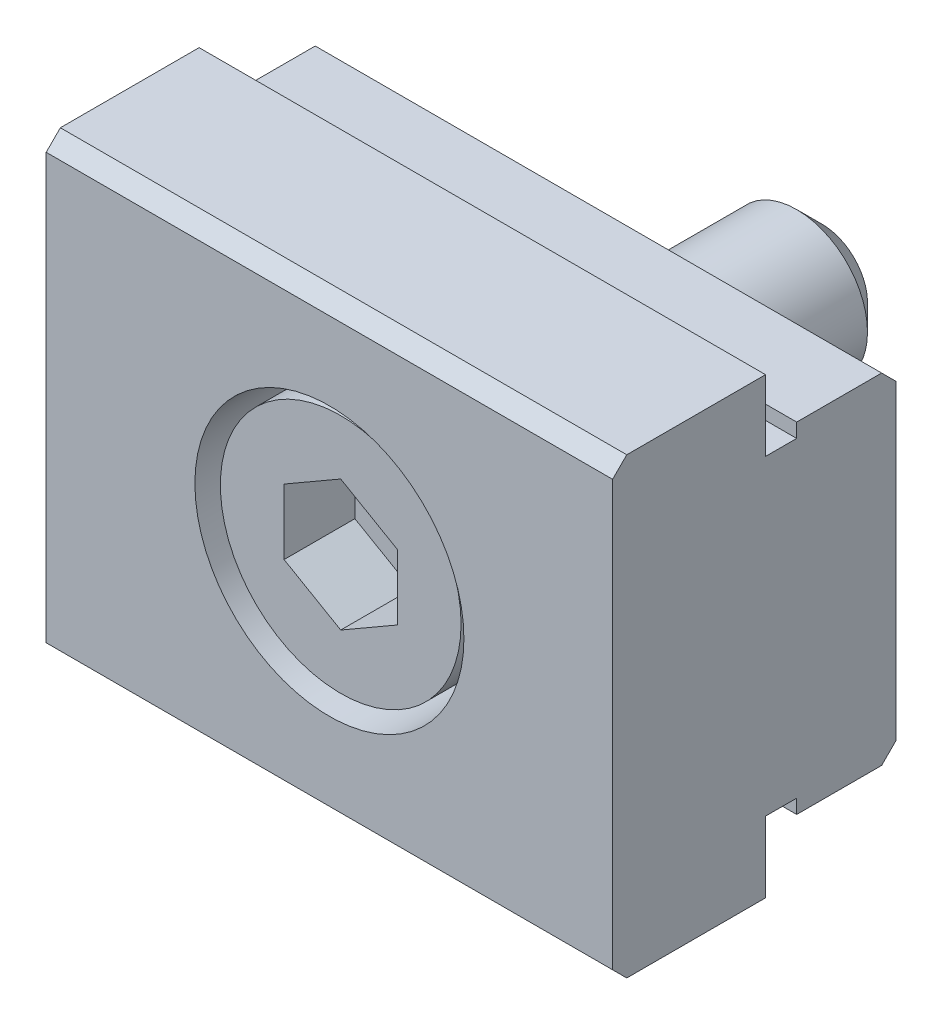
ISO-10303-21;
HEADER;
FILE_DESCRIPTION(('STEP AP214'),'2;1');
FILE_NAME('part.step','',(''),(''),'','','');
FILE_SCHEMA(('AUTOMOTIVE_DESIGN { 1 0 10303 214 1 1 1 1 }'));
ENDSEC;
DATA;
#1=APPLICATION_CONTEXT('core data for automotive mechanical design processes');
#2=APPLICATION_PROTOCOL_DEFINITION('international standard','automotive_design',2000,#1);
#3=PRODUCT_CONTEXT('',#1,'mechanical');
#4=PRODUCT('Part','Part','',(#3));
#5=PRODUCT_RELATED_PRODUCT_CATEGORY('part','',(#4));
#6=PRODUCT_DEFINITION_FORMATION('','',#4);
#7=PRODUCT_DEFINITION_CONTEXT('part definition',#1,'design');
#8=PRODUCT_DEFINITION('design','',#6,#7);
#9=PRODUCT_DEFINITION_SHAPE('','',#8);
#10=(LENGTH_UNIT() NAMED_UNIT(*) SI_UNIT(.MILLI.,.METRE.));
#11=(NAMED_UNIT(*) PLANE_ANGLE_UNIT() SI_UNIT($,.RADIAN.));
#12=(NAMED_UNIT(*) SI_UNIT($,.STERADIAN.) SOLID_ANGLE_UNIT());
#13=UNCERTAINTY_MEASURE_WITH_UNIT(LENGTH_MEASURE(1.E-05),#10,'distance_accuracy_value','');
#14=(GEOMETRIC_REPRESENTATION_CONTEXT(3) GLOBAL_UNCERTAINTY_ASSIGNED_CONTEXT((#13)) GLOBAL_UNIT_ASSIGNED_CONTEXT((#10,
#11,#12)) REPRESENTATION_CONTEXT('',''));
#15=CARTESIAN_POINT('',(0.,0.,0.));
#16=DIRECTION('',(0.,0.,1.));
#17=DIRECTION('',(1.,0.,0.));
#18=AXIS2_PLACEMENT_3D('',#15,#16,#17);
#19=CARTESIAN_POINT('',(-12.5,-6.,-1.1));
#20=DIRECTION('',(0.,0.,-1.));
#21=DIRECTION('',(-1.,0.,0.));
#22=AXIS2_PLACEMENT_3D('',#19,#20,#21);
#23=PLANE('',#22);
#24=DIRECTION('',(0.,1.,0.));
#25=VECTOR('',#24,1.);
#26=CARTESIAN_POINT('',(-10.,-6.,-1.1));
#27=LINE('',#26,#25);
#28=CARTESIAN_POINT('',(-10.,-6.,-1.1));
#29=VERTEX_POINT('',#28);
#30=CARTESIAN_POINT('',(-10.,-5.5,-1.1));
#31=VERTEX_POINT('',#30);
#32=EDGE_CURVE('E353',#29,#31,#27,.T.);
#33=ORIENTED_EDGE('',*,*,#32,.F.);
#34=DIRECTION('',(1.,0.,0.));
#35=VECTOR('',#34,1.);
#36=CARTESIAN_POINT('',(-12.5,-6.,-1.1));
#37=LINE('',#36,#35);
#38=CARTESIAN_POINT('',(10.,-6.,-1.1));
#39=VERTEX_POINT('',#38);
#40=EDGE_CURVE('E208',#29,#39,#37,.T.);
#41=ORIENTED_EDGE('',*,*,#40,.T.);
#42=DIRECTION('',(0.,-1.,0.));
#43=VECTOR('',#42,1.);
#44=CARTESIAN_POINT('',(10.,-6.,-1.1));
#45=LINE('',#44,#43);
#46=CARTESIAN_POINT('',(10.,-5.5,-1.1));
#47=VERTEX_POINT('',#46);
#48=EDGE_CURVE('E336',#47,#39,#45,.T.);
#49=ORIENTED_EDGE('',*,*,#48,.F.);
#50=DIRECTION('',(1.,0.,0.));
#51=VECTOR('',#50,1.);
#52=CARTESIAN_POINT('',(-12.5,-5.5,-1.1));
#53=LINE('',#52,#51);
#54=EDGE_CURVE('E200',#31,#47,#53,.T.);
#55=ORIENTED_EDGE('',*,*,#54,.F.);
#56=EDGE_LOOP('',(#33,#41,#49,#55));
#57=FACE_BOUND('',#56,.T.);
#58=ADVANCED_FACE('F14',(#57),#23,.F.);
#59=CARTESIAN_POINT('',(-12.5,-6.,-4.1));
#60=DIRECTION('',(0.,1.,0.));
#61=DIRECTION('',(1.,0.,0.));
#62=AXIS2_PLACEMENT_3D('',#59,#60,#61);
#63=PLANE('',#62);
#64=DIRECTION('',(0.,0.,1.));
#65=VECTOR('',#64,1.);
#66=CARTESIAN_POINT('',(-10.,-6.,-4.1));
#67=LINE('',#66,#65);
#68=CARTESIAN_POINT('',(-10.,-6.,-4.1));
#69=VERTEX_POINT('',#68);
#70=EDGE_CURVE('E355',#69,#29,#67,.T.);
#71=ORIENTED_EDGE('',*,*,#70,.F.);
#72=DIRECTION('',(1.,0.,0.));
#73=VECTOR('',#72,1.);
#74=CARTESIAN_POINT('',(-12.5,-6.,-4.1));
#75=LINE('',#74,#73);
#76=CARTESIAN_POINT('',(10.,-6.,-4.1));
#77=VERTEX_POINT('',#76);
#78=EDGE_CURVE('E211',#69,#77,#75,.T.);
#79=ORIENTED_EDGE('',*,*,#78,.T.);
#80=DIRECTION('',(0.,0.,-1.));
#81=VECTOR('',#80,1.);
#82=CARTESIAN_POINT('',(10.,-6.,-4.1));
#83=LINE('',#82,#81);
#84=EDGE_CURVE('E338',#39,#77,#83,.T.);
#85=ORIENTED_EDGE('',*,*,#84,.F.);
#86=ORIENTED_EDGE('',*,*,#40,.F.);
#87=EDGE_LOOP('',(#71,#79,#85,#86));
#88=FACE_BOUND('',#87,.T.);
#89=ADVANCED_FACE('F405',(#88),#63,.F.);
#90=CARTESIAN_POINT('',(-12.5,6.,-4.1));
#91=DIRECTION('',(0.,-1.,0.));
#92=DIRECTION('',(-1.,0.,0.));
#93=AXIS2_PLACEMENT_3D('',#90,#91,#92);
#94=PLANE('',#93);
#95=DIRECTION('',(0.,0.,-1.));
#96=VECTOR('',#95,1.);
#97=CARTESIAN_POINT('',(-10.,6.,-4.1));
#98=LINE('',#97,#96);
#99=CARTESIAN_POINT('',(-10.,6.,-1.1));
#100=VERTEX_POINT('',#99);
#101=CARTESIAN_POINT('',(-10.,6.,-4.1));
#102=VERTEX_POINT('',#101);
#103=EDGE_CURVE('E363',#100,#102,#98,.T.);
#104=ORIENTED_EDGE('',*,*,#103,.F.);
#105=DIRECTION('',(1.,0.,0.));
#106=VECTOR('',#105,1.);
#107=CARTESIAN_POINT('',(-12.5,6.,-1.1));
#108=LINE('',#107,#106);
#109=CARTESIAN_POINT('',(10.,6.,-1.1));
#110=VERTEX_POINT('',#109);
#111=EDGE_CURVE('E223',#100,#110,#108,.T.);
#112=ORIENTED_EDGE('',*,*,#111,.T.);
#113=DIRECTION('',(0.,0.,1.));
#114=VECTOR('',#113,1.);
#115=CARTESIAN_POINT('',(10.,6.,-4.1));
#116=LINE('',#115,#114);
#117=CARTESIAN_POINT('',(10.,6.,-4.1));
#118=VERTEX_POINT('',#117);
#119=EDGE_CURVE('E346',#118,#110,#116,.T.);
#120=ORIENTED_EDGE('',*,*,#119,.F.);
#121=DIRECTION('',(1.,0.,0.));
#122=VECTOR('',#121,1.);
#123=CARTESIAN_POINT('',(-12.5,6.,-4.1));
#124=LINE('',#123,#122);
#125=EDGE_CURVE('E220',#102,#118,#124,.T.);
#126=ORIENTED_EDGE('',*,*,#125,.F.);
#127=EDGE_LOOP('',(#104,#112,#120,#126));
#128=FACE_BOUND('',#127,.T.);
#129=ADVANCED_FACE('F385',(#128),#94,.F.);
#130=CARTESIAN_POINT('',(-12.5,6.,-1.1));
#131=DIRECTION('',(0.,0.,-1.));
#132=DIRECTION('',(-1.,0.,0.));
#133=AXIS2_PLACEMENT_3D('',#130,#131,#132);
#134=PLANE('',#133);
#135=DIRECTION('',(0.,1.,0.));
#136=VECTOR('',#135,1.);
#137=CARTESIAN_POINT('',(-10.,6.,-1.1));
#138=LINE('',#137,#136);
#139=CARTESIAN_POINT('',(-10.,5.5,-1.1));
#140=VERTEX_POINT('',#139);
#141=EDGE_CURVE('E365',#140,#100,#138,.T.);
#142=ORIENTED_EDGE('',*,*,#141,.F.);
#143=DIRECTION('',(1.,0.,0.));
#144=VECTOR('',#143,1.);
#145=CARTESIAN_POINT('',(-12.5,5.5,-1.1));
#146=LINE('',#145,#144);
#147=CARTESIAN_POINT('',(10.,5.5,-1.1));
#148=VERTEX_POINT('',#147);
#149=EDGE_CURVE('E226',#140,#148,#146,.T.);
#150=ORIENTED_EDGE('',*,*,#149,.T.);
#151=DIRECTION('',(0.,-1.,0.));
#152=VECTOR('',#151,1.);
#153=CARTESIAN_POINT('',(10.,6.,-1.1));
#154=LINE('',#153,#152);
#155=EDGE_CURVE('E348',#110,#148,#154,.T.);
#156=ORIENTED_EDGE('',*,*,#155,.F.);
#157=ORIENTED_EDGE('',*,*,#111,.F.);
#158=EDGE_LOOP('',(#142,#150,#156,#157));
#159=FACE_BOUND('',#158,.T.);
#160=ADVANCED_FACE('F375',(#159),#134,.F.);
#161=CARTESIAN_POINT('',(-12.5,5.5,-1.1));
#162=DIRECTION('',(0.,-1.,0.));
#163=DIRECTION('',(-1.,0.,0.));
#164=AXIS2_PLACEMENT_3D('',#161,#162,#163);
#165=PLANE('',#164);
#166=DIRECTION('',(0.,0.,-1.));
#167=VECTOR('',#166,1.);
#168=CARTESIAN_POINT('',(-10.,5.5,-1.1));
#169=LINE('',#168,#167);
#170=CARTESIAN_POINT('',(-10.,5.5,0.));
#171=VERTEX_POINT('',#170);
#172=EDGE_CURVE('E202',#171,#140,#169,.T.);
#173=ORIENTED_EDGE('',*,*,#172,.F.);
#174=DIRECTION('',(-1.,0.,0.));
#175=VECTOR('',#174,1.);
#176=CARTESIAN_POINT('',(10.,5.5,0.));
#177=LINE('',#176,#175);
#178=CARTESIAN_POINT('',(10.,5.5,0.));
#179=VERTEX_POINT('',#178);
#180=EDGE_CURVE('E312',#179,#171,#177,.T.);
#181=ORIENTED_EDGE('',*,*,#180,.F.);
#182=DIRECTION('',(0.,0.,1.));
#183=VECTOR('',#182,1.);
#184=CARTESIAN_POINT('',(10.,5.5,-1.1));
#185=LINE('',#184,#183);
#186=EDGE_CURVE('E183',#148,#179,#185,.T.);
#187=ORIENTED_EDGE('',*,*,#186,.F.);
#188=ORIENTED_EDGE('',*,*,#149,.F.);
#189=EDGE_LOOP('',(#173,#181,#187,#188));
#190=FACE_BOUND('',#189,.T.);
#191=ADVANCED_FACE('F378',(#190),#165,.F.);
#192=CARTESIAN_POINT('',(-10.,5.5,0.));
#193=DIRECTION('',(0.,0.,-1.));
#194=DIRECTION('',(-1.,0.,0.));
#195=AXIS2_PLACEMENT_3D('',#192,#193,#194);
#196=PLANE('',#195);
#197=ORIENTED_EDGE('',*,*,#180,.T.);
#198=DIRECTION('',(0.,1.,0.));
#199=VECTOR('',#198,1.);
#200=CARTESIAN_POINT('',(-10.,5.5,0.));
#201=LINE('',#200,#199);
#202=CARTESIAN_POINT('',(-10.,8.,0.));
#203=VERTEX_POINT('',#202);
#204=EDGE_CURVE('E315',#171,#203,#201,.T.);
#205=ORIENTED_EDGE('',*,*,#204,.T.);
#206=DIRECTION('',(1.,0.,0.));
#207=VECTOR('',#206,1.);
#208=CARTESIAN_POINT('',(-10.,8.,0.));
#209=LINE('',#208,#207);
#210=CARTESIAN_POINT('',(10.,8.,0.));
#211=VERTEX_POINT('',#210);
#212=EDGE_CURVE('E317',#203,#211,#209,.T.);
#213=ORIENTED_EDGE('',*,*,#212,.T.);
#214=DIRECTION('',(0.,-1.,0.));
#215=VECTOR('',#214,1.);
#216=CARTESIAN_POINT('',(10.,8.,0.));
#217=LINE('',#216,#215);
#218=EDGE_CURVE('E319',#211,#179,#217,.T.);
#219=ORIENTED_EDGE('',*,*,#218,.T.);
#220=EDGE_LOOP('',(#197,#205,#213,#219));
#221=FACE_BOUND('',#220,.T.);
#222=ADVANCED_FACE('F425',(#221),#196,.T.);
#223=CARTESIAN_POINT('',(-12.5,8.,-0.1));
#224=DIRECTION('',(0.,-1.,0.));
#225=DIRECTION('',(-1.,0.,0.));
#226=AXIS2_PLACEMENT_3D('',#223,#224,#225);
#227=PLANE('',#226);
#228=ORIENTED_EDGE('',*,*,#212,.F.);
#229=DIRECTION('',(0.,0.,1.));
#230=VECTOR('',#229,1.);
#231=CARTESIAN_POINT('',(-10.,8.,-14.6));
#232=LINE('',#231,#230);
#233=CARTESIAN_POINT('',(-10.,8.,4.9));
#234=VERTEX_POINT('',#233);
#235=EDGE_CURVE('E322',#203,#234,#232,.T.);
#236=ORIENTED_EDGE('',*,*,#235,.T.);
#237=DIRECTION('',(1.,0.,0.));
#238=VECTOR('',#237,1.);
#239=CARTESIAN_POINT('',(-12.5,8.,4.9));
#240=LINE('',#239,#238);
#241=CARTESIAN_POINT('',(10.,8.,4.9));
#242=VERTEX_POINT('',#241);
#243=EDGE_CURVE('E229',#234,#242,#240,.T.);
#244=ORIENTED_EDGE('',*,*,#243,.T.);
#245=DIRECTION('',(0.,0.,-1.));
#246=VECTOR('',#245,1.);
#247=CARTESIAN_POINT('',(10.,8.,-14.6));
#248=LINE('',#247,#246);
#249=EDGE_CURVE('E324',#242,#211,#248,.T.);
#250=ORIENTED_EDGE('',*,*,#249,.T.);
#251=EDGE_LOOP('',(#228,#236,#244,#250));
#252=FACE_BOUND('',#251,.T.);
#253=ADVANCED_FACE('F423',(#252),#227,.F.);
#254=CARTESIAN_POINT('',(-12.5,8.,4.9));
#255=DIRECTION('',(0.,-0.707106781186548,-0.707106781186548));
#256=DIRECTION('',(0.,-0.707106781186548,0.707106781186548));
#257=AXIS2_PLACEMENT_3D('',#254,#255,#256);
#258=PLANE('',#257);
#259=DIRECTION('',(0.,0.707106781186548,-0.707106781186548));
#260=VECTOR('',#259,1.);
#261=CARTESIAN_POINT('',(-10.,8.,4.9));
#262=LINE('',#261,#260);
#263=CARTESIAN_POINT('',(-10.,7.5,5.4));
#264=VERTEX_POINT('',#263);
#265=EDGE_CURVE('E182',#264,#234,#262,.T.);
#266=ORIENTED_EDGE('',*,*,#265,.F.);
#267=DIRECTION('',(1.,0.,0.));
#268=VECTOR('',#267,1.);
#269=CARTESIAN_POINT('',(-12.5,7.5,5.4));
#270=LINE('',#269,#268);
#271=CARTESIAN_POINT('',(10.,7.5,5.4));
#272=VERTEX_POINT('',#271);
#273=EDGE_CURVE('E192',#264,#272,#270,.T.);
#274=ORIENTED_EDGE('',*,*,#273,.T.);
#275=DIRECTION('',(0.,-0.707106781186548,0.707106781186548));
#276=VECTOR('',#275,1.);
#277=CARTESIAN_POINT('',(10.,8.,4.9));
#278=LINE('',#277,#276);
#279=EDGE_CURVE('E332',#242,#272,#278,.T.);
#280=ORIENTED_EDGE('',*,*,#279,.F.);
#281=ORIENTED_EDGE('',*,*,#243,.F.);
#282=EDGE_LOOP('',(#266,#274,#280,#281));
#283=FACE_BOUND('',#282,.T.);
#284=ADVANCED_FACE('F419',(#283),#258,.F.);
#285=CARTESIAN_POINT('',(-12.5,7.5,5.4));
#286=DIRECTION('',(0.,0.,-1.));
#287=DIRECTION('',(-1.,0.,0.));
#288=AXIS2_PLACEMENT_3D('',#285,#286,#287);
#289=PLANE('',#288);
#290=CARTESIAN_POINT('',(0.,0.,5.4));
#291=DIRECTION('',(0.,0.,1.));
#292=DIRECTION('',(1.,0.,0.));
#293=AXIS2_PLACEMENT_3D('',#290,#291,#292);
#294=CIRCLE('',#293,4.75);
#295=CARTESIAN_POINT('',(4.75,0.,5.4));
#296=VERTEX_POINT('',#295);
#297=EDGE_CURVE('E301',#296,#296,#294,.T.);
#298=ORIENTED_EDGE('',*,*,#297,.F.);
#299=EDGE_LOOP('',(#298));
#300=FACE_BOUND('',#299,.T.);
#301=DIRECTION('',(0.,1.,0.));
#302=VECTOR('',#301,1.);
#303=CARTESIAN_POINT('',(-10.,7.5,5.4));
#304=LINE('',#303,#302);
#305=CARTESIAN_POINT('',(-10.,-7.5,5.4));
#306=VERTEX_POINT('',#305);
#307=EDGE_CURVE('E24',#306,#264,#304,.T.);
#308=ORIENTED_EDGE('',*,*,#307,.F.);
#309=DIRECTION('',(1.,0.,0.));
#310=VECTOR('',#309,1.);
#311=CARTESIAN_POINT('',(-12.5,-7.5,5.4));
#312=LINE('',#311,#310);
#313=CARTESIAN_POINT('',(10.,-7.5,5.4));
#314=VERTEX_POINT('',#313);
#315=EDGE_CURVE('E190',#306,#314,#312,.T.);
#316=ORIENTED_EDGE('',*,*,#315,.T.);
#317=DIRECTION('',(0.,-1.,0.));
#318=VECTOR('',#317,1.);
#319=CARTESIAN_POINT('',(10.,7.5,5.4));
#320=LINE('',#319,#318);
#321=EDGE_CURVE('E193',#272,#314,#320,.T.);
#322=ORIENTED_EDGE('',*,*,#321,.F.);
#323=ORIENTED_EDGE('',*,*,#273,.F.);
#324=EDGE_LOOP('',(#308,#316,#322,#323));
#325=FACE_BOUND('',#324,.T.);
#326=ADVANCED_FACE('F188',(#300,#325),#289,.F.);
#327=CARTESIAN_POINT('',(0.,0.,5.4));
#328=DIRECTION('',(0.,0.,1.));
#329=DIRECTION('',(1.,0.,0.));
#330=AXIS2_PLACEMENT_3D('',#327,#328,#329);
#331=CYLINDRICAL_SURFACE('',#330,4.75);
#332=CARTESIAN_POINT('',(0.,0.,0.));
#333=DIRECTION('',(0.,0.,1.));
#334=DIRECTION('',(1.,0.,0.));
#335=AXIS2_PLACEMENT_3D('',#332,#333,#334);
#336=CIRCLE('',#335,4.75);
#337=CARTESIAN_POINT('',(4.75,0.,0.));
#338=VERTEX_POINT('',#337);
#339=EDGE_CURVE('E296',#338,#338,#336,.T.);
#340=ORIENTED_EDGE('',*,*,#339,.F.);
#341=EDGE_LOOP('',(#340));
#342=FACE_BOUND('',#341,.T.);
#343=ORIENTED_EDGE('',*,*,#297,.T.);
#344=EDGE_LOOP('',(#343));
#345=FACE_BOUND('',#344,.T.);
#346=ADVANCED_FACE('F705',(#342,#345),#331,.F.);
#347=CARTESIAN_POINT('',(-2.75,0.,0.));
#348=DIRECTION('',(0.,0.,-1.));
#349=DIRECTION('',(-1.,0.,0.));
#350=AXIS2_PLACEMENT_3D('',#347,#348,#349);
#351=PLANE('',#350);
#352=CARTESIAN_POINT('',(0.,0.,0.));
#353=DIRECTION('',(0.,0.,-1.));
#354=DIRECTION('',(-1.,0.,0.));
#355=AXIS2_PLACEMENT_3D('',#352,#353,#354);
#356=CIRCLE('',#355,4.25);
#357=CARTESIAN_POINT('',(-4.25,0.,0.));
#358=VERTEX_POINT('',#357);
#359=EDGE_CURVE('E9',#358,#358,#356,.T.);
#360=ORIENTED_EDGE('',*,*,#359,.T.);
#361=EDGE_LOOP('',(#360));
#362=FACE_BOUND('',#361,.T.);
#363=ORIENTED_EDGE('',*,*,#339,.T.);
#364=EDGE_LOOP('',(#363));
#365=FACE_BOUND('',#364,.T.);
#366=ADVANCED_FACE('F696',(#362,#365),#351,.F.);
#367=CARTESIAN_POINT('',(-12.5,-8.,4.9));
#368=DIRECTION('',(0.,0.707106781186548,-0.707106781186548));
#369=DIRECTION('',(0.,-0.707106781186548,-0.707106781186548));
#370=AXIS2_PLACEMENT_3D('',#367,#368,#369);
#371=PLANE('',#370);
#372=DIRECTION('',(0.,0.707106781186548,0.707106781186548));
#373=VECTOR('',#372,1.);
#374=CARTESIAN_POINT('',(-10.,-8.,4.9));
#375=LINE('',#374,#373);
#376=CARTESIAN_POINT('',(-10.,-8.,4.9));
#377=VERTEX_POINT('',#376);
#378=EDGE_CURVE('E171',#377,#306,#375,.T.);
#379=ORIENTED_EDGE('',*,*,#378,.F.);
#380=DIRECTION('',(1.,0.,0.));
#381=VECTOR('',#380,1.);
#382=CARTESIAN_POINT('',(-12.5,-8.,4.9));
#383=LINE('',#382,#381);
#384=CARTESIAN_POINT('',(10.,-8.,4.9));
#385=VERTEX_POINT('',#384);
#386=EDGE_CURVE('E198',#377,#385,#383,.T.);
#387=ORIENTED_EDGE('',*,*,#386,.T.);
#388=DIRECTION('',(0.,-0.707106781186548,-0.707106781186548));
#389=VECTOR('',#388,1.);
#390=CARTESIAN_POINT('',(10.,-8.,4.9));
#391=LINE('',#390,#389);
#392=EDGE_CURVE('E197',#314,#385,#391,.T.);
#393=ORIENTED_EDGE('',*,*,#392,.F.);
#394=ORIENTED_EDGE('',*,*,#315,.F.);
#395=EDGE_LOOP('',(#379,#387,#393,#394));
#396=FACE_BOUND('',#395,.T.);
#397=ADVANCED_FACE('F196',(#396),#371,.F.);
#398=CARTESIAN_POINT('',(-12.5,-8.,-0.1));
#399=DIRECTION('',(0.,1.,0.));
#400=DIRECTION('',(1.,0.,0.));
#401=AXIS2_PLACEMENT_3D('',#398,#399,#400);
#402=PLANE('',#401);
#403=DIRECTION('',(-1.,0.,0.));
#404=VECTOR('',#403,1.);
#405=CARTESIAN_POINT('',(10.,-8.,0.));
#406=LINE('',#405,#404);
#407=CARTESIAN_POINT('',(10.,-8.,0.));
#408=VERTEX_POINT('',#407);
#409=CARTESIAN_POINT('',(-10.,-8.,0.));
#410=VERTEX_POINT('',#409);
#411=EDGE_CURVE('E33',#408,#410,#406,.T.);
#412=ORIENTED_EDGE('',*,*,#411,.F.);
#413=DIRECTION('',(0.,0.,-1.));
#414=VECTOR('',#413,1.);
#415=CARTESIAN_POINT('',(10.,-8.,-14.6));
#416=LINE('',#415,#414);
#417=EDGE_CURVE('E328',#385,#408,#416,.T.);
#418=ORIENTED_EDGE('',*,*,#417,.F.);
#419=ORIENTED_EDGE('',*,*,#386,.F.);
#420=DIRECTION('',(0.,0.,1.));
#421=VECTOR('',#420,1.);
#422=CARTESIAN_POINT('',(-10.,-8.,-14.6));
#423=LINE('',#422,#421);
#424=EDGE_CURVE('E177',#410,#377,#423,.T.);
#425=ORIENTED_EDGE('',*,*,#424,.F.);
#426=EDGE_LOOP('',(#412,#418,#419,#425));
#427=FACE_BOUND('',#426,.T.);
#428=ADVANCED_FACE('F415',(#427),#402,.F.);
#429=CARTESIAN_POINT('',(-10.,-8.,0.));
#430=DIRECTION('',(0.,0.,-1.));
#431=DIRECTION('',(-1.,0.,0.));
#432=AXIS2_PLACEMENT_3D('',#429,#430,#431);
#433=PLANE('',#432);
#434=ORIENTED_EDGE('',*,*,#411,.T.);
#435=DIRECTION('',(0.,1.,0.));
#436=VECTOR('',#435,1.);
#437=CARTESIAN_POINT('',(-10.,-8.,0.));
#438=LINE('',#437,#436);
#439=CARTESIAN_POINT('',(-10.,-5.5,0.));
#440=VERTEX_POINT('',#439);
#441=EDGE_CURVE('E305',#410,#440,#438,.T.);
#442=ORIENTED_EDGE('',*,*,#441,.T.);
#443=DIRECTION('',(1.,0.,0.));
#444=VECTOR('',#443,1.);
#445=CARTESIAN_POINT('',(-10.,-5.5,0.));
#446=LINE('',#445,#444);
#447=CARTESIAN_POINT('',(10.,-5.5,0.));
#448=VERTEX_POINT('',#447);
#449=EDGE_CURVE('E307',#440,#448,#446,.T.);
#450=ORIENTED_EDGE('',*,*,#449,.T.);
#451=DIRECTION('',(0.,-1.,0.));
#452=VECTOR('',#451,1.);
#453=CARTESIAN_POINT('',(10.,-5.5,0.));
#454=LINE('',#453,#452);
#455=EDGE_CURVE('E310',#448,#408,#454,.T.);
#456=ORIENTED_EDGE('',*,*,#455,.T.);
#457=EDGE_LOOP('',(#434,#442,#450,#456));
#458=FACE_BOUND('',#457,.T.);
#459=ADVANCED_FACE('F413',(#458),#433,.T.);
#460=CARTESIAN_POINT('',(-12.5,-5.5,-1.1));
#461=DIRECTION('',(0.,1.,0.));
#462=DIRECTION('',(1.,0.,0.));
#463=AXIS2_PLACEMENT_3D('',#460,#461,#462);
#464=PLANE('',#463);
#465=DIRECTION('',(0.,0.,1.));
#466=VECTOR('',#465,1.);
#467=CARTESIAN_POINT('',(-10.,-5.5,-1.1));
#468=LINE('',#467,#466);
#469=EDGE_CURVE('E86',#31,#440,#468,.T.);
#470=ORIENTED_EDGE('',*,*,#469,.F.);
#471=ORIENTED_EDGE('',*,*,#54,.T.);
#472=DIRECTION('',(0.,0.,-1.));
#473=VECTOR('',#472,1.);
#474=CARTESIAN_POINT('',(10.,-5.5,-1.1));
#475=LINE('',#474,#473);
#476=EDGE_CURVE('E334',#448,#47,#475,.T.);
#477=ORIENTED_EDGE('',*,*,#476,.F.);
#478=ORIENTED_EDGE('',*,*,#449,.F.);
#479=EDGE_LOOP('',(#470,#471,#477,#478));
#480=FACE_BOUND('',#479,.T.);
#481=ADVANCED_FACE('F412',(#480),#464,.F.);
#482=CARTESIAN_POINT('',(-12.5,-5.5,-4.6));
#483=DIRECTION('',(0.,0.707106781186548,0.707106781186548));
#484=DIRECTION('',(0.,0.707106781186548,-0.707106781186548));
#485=AXIS2_PLACEMENT_3D('',#482,#483,#484);
#486=PLANE('',#485);
#487=DIRECTION('',(0.,-0.707106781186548,0.707106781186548));
#488=VECTOR('',#487,1.);
#489=CARTESIAN_POINT('',(-10.,-5.5,-4.6));
#490=LINE('',#489,#488);
#491=CARTESIAN_POINT('',(-10.,-5.5,-4.6));
#492=VERTEX_POINT('',#491);
#493=EDGE_CURVE('E357',#492,#69,#490,.T.);
#494=ORIENTED_EDGE('',*,*,#493,.F.);
#495=DIRECTION('',(1.,0.,0.));
#496=VECTOR('',#495,1.);
#497=CARTESIAN_POINT('',(-12.5,-5.5,-4.6));
#498=LINE('',#497,#496);
#499=CARTESIAN_POINT('',(10.,-5.5,-4.6));
#500=VERTEX_POINT('',#499);
#501=EDGE_CURVE('E214',#492,#500,#498,.T.);
#502=ORIENTED_EDGE('',*,*,#501,.T.);
#503=DIRECTION('',(0.,0.707106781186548,-0.707106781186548));
#504=VECTOR('',#503,1.);
#505=CARTESIAN_POINT('',(10.,-5.5,-4.6));
#506=LINE('',#505,#504);
#507=EDGE_CURVE('E340',#77,#500,#506,.T.);
#508=ORIENTED_EDGE('',*,*,#507,.F.);
#509=ORIENTED_EDGE('',*,*,#78,.F.);
#510=EDGE_LOOP('',(#494,#502,#508,#509));
#511=FACE_BOUND('',#510,.T.);
#512=ADVANCED_FACE('F401',(#511),#486,.F.);
#513=CARTESIAN_POINT('',(10.,-8.,-14.6));
#514=DIRECTION('',(1.,0.,0.));
#515=DIRECTION('',(0.,-1.,0.));
#516=AXIS2_PLACEMENT_3D('',#513,#514,#515);
#517=PLANE('',#516);
#518=ORIENTED_EDGE('',*,*,#455,.F.);
#519=ORIENTED_EDGE('',*,*,#476,.T.);
#520=ORIENTED_EDGE('',*,*,#48,.T.);
#521=ORIENTED_EDGE('',*,*,#84,.T.);
#522=ORIENTED_EDGE('',*,*,#507,.T.);
#523=DIRECTION('',(0.,1.,0.));
#524=VECTOR('',#523,1.);
#525=CARTESIAN_POINT('',(10.,5.5,-4.6));
#526=LINE('',#525,#524);
#527=CARTESIAN_POINT('',(10.,5.5,-4.6));
#528=VERTEX_POINT('',#527);
#529=EDGE_CURVE('E342',#500,#528,#526,.T.);
#530=ORIENTED_EDGE('',*,*,#529,.T.);
#531=DIRECTION('',(0.,0.707106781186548,0.707106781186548));
#532=VECTOR('',#531,1.);
#533=CARTESIAN_POINT('',(10.,5.5,-4.6));
#534=LINE('',#533,#532);
#535=EDGE_CURVE('E344',#528,#118,#534,.T.);
#536=ORIENTED_EDGE('',*,*,#535,.T.);
#537=ORIENTED_EDGE('',*,*,#119,.T.);
#538=ORIENTED_EDGE('',*,*,#155,.T.);
#539=ORIENTED_EDGE('',*,*,#186,.T.);
#540=ORIENTED_EDGE('',*,*,#218,.F.);
#541=ORIENTED_EDGE('',*,*,#249,.F.);
#542=ORIENTED_EDGE('',*,*,#279,.T.);
#543=ORIENTED_EDGE('',*,*,#321,.T.);
#544=ORIENTED_EDGE('',*,*,#392,.T.);
#545=ORIENTED_EDGE('',*,*,#417,.T.);
#546=EDGE_LOOP('',(#518,#519,#520,#521,#522,#530,#536,#537,#538,#539,#540,#541,#542,#543,#544,#545));
#547=FACE_BOUND('',#546,.T.);
#548=ADVANCED_FACE('F382',(#547),#517,.T.);
#549=CARTESIAN_POINT('',(-12.5,5.5,-4.6));
#550=DIRECTION('',(0.,-0.707106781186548,0.707106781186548));
#551=DIRECTION('',(0.,0.707106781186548,0.707106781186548));
#552=AXIS2_PLACEMENT_3D('',#549,#550,#551);
#553=PLANE('',#552);
#554=DIRECTION('',(0.,-0.707106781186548,-0.707106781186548));
#555=VECTOR('',#554,1.);
#556=CARTESIAN_POINT('',(-10.,5.5,-4.6));
#557=LINE('',#556,#555);
#558=CARTESIAN_POINT('',(-10.,5.5,-4.6));
#559=VERTEX_POINT('',#558);
#560=EDGE_CURVE('E361',#102,#559,#557,.T.);
#561=ORIENTED_EDGE('',*,*,#560,.F.);
#562=ORIENTED_EDGE('',*,*,#125,.T.);
#563=ORIENTED_EDGE('',*,*,#535,.F.);
#564=DIRECTION('',(1.,0.,0.));
#565=VECTOR('',#564,1.);
#566=CARTESIAN_POINT('',(-12.5,5.5,-4.6));
#567=LINE('',#566,#565);
#568=EDGE_CURVE('E217',#559,#528,#567,.T.);
#569=ORIENTED_EDGE('',*,*,#568,.F.);
#570=EDGE_LOOP('',(#561,#562,#563,#569));
#571=FACE_BOUND('',#570,.T.);
#572=ADVANCED_FACE('F391',(#571),#553,.F.);
#573=CARTESIAN_POINT('',(-10.,-8.,-14.6));
#574=DIRECTION('',(-1.,0.,0.));
#575=DIRECTION('',(0.,1.,0.));
#576=AXIS2_PLACEMENT_3D('',#573,#574,#575);
#577=PLANE('',#576);
#578=ORIENTED_EDGE('',*,*,#469,.T.);
#579=ORIENTED_EDGE('',*,*,#441,.F.);
#580=ORIENTED_EDGE('',*,*,#424,.T.);
#581=ORIENTED_EDGE('',*,*,#378,.T.);
#582=ORIENTED_EDGE('',*,*,#307,.T.);
#583=ORIENTED_EDGE('',*,*,#265,.T.);
#584=ORIENTED_EDGE('',*,*,#235,.F.);
#585=ORIENTED_EDGE('',*,*,#204,.F.);
#586=ORIENTED_EDGE('',*,*,#172,.T.);
#587=ORIENTED_EDGE('',*,*,#141,.T.);
#588=ORIENTED_EDGE('',*,*,#103,.T.);
#589=ORIENTED_EDGE('',*,*,#560,.T.);
#590=DIRECTION('',(0.,-1.,0.));
#591=VECTOR('',#590,1.);
#592=CARTESIAN_POINT('',(-10.,5.5,-4.6));
#593=LINE('',#592,#591);
#594=EDGE_CURVE('E359',#559,#492,#593,.T.);
#595=ORIENTED_EDGE('',*,*,#594,.T.);
#596=ORIENTED_EDGE('',*,*,#493,.T.);
#597=ORIENTED_EDGE('',*,*,#70,.T.);
#598=ORIENTED_EDGE('',*,*,#32,.T.);
#599=EDGE_LOOP('',(#578,#579,#580,#581,#582,#583,#584,#585,#586,#587,#588,#589,#595,#596,#597,#598));
#600=FACE_BOUND('',#599,.T.);
#601=ADVANCED_FACE('F173',(#600),#577,.T.);
#602=CARTESIAN_POINT('',(-12.5,5.5,-4.6));
#603=DIRECTION('',(0.,0.,1.));
#604=DIRECTION('',(1.,0.,0.));
#605=AXIS2_PLACEMENT_3D('',#602,#603,#604);
#606=PLANE('',#605);
#607=CARTESIAN_POINT('',(0.,0.,-4.6));
#608=DIRECTION('',(0.,0.,1.));
#609=DIRECTION('',(1.,0.,0.));
#610=AXIS2_PLACEMENT_3D('',#607,#608,#609);
#611=CIRCLE('',#610,2.75);
#612=CARTESIAN_POINT('',(2.75,0.,-4.6));
#613=VERTEX_POINT('',#612);
#614=EDGE_CURVE('E287',#613,#613,#611,.T.);
#615=ORIENTED_EDGE('',*,*,#614,.T.);
#616=EDGE_LOOP('',(#615));
#617=FACE_BOUND('',#616,.T.);
#618=ORIENTED_EDGE('',*,*,#594,.F.);
#619=ORIENTED_EDGE('',*,*,#568,.T.);
#620=ORIENTED_EDGE('',*,*,#529,.F.);
#621=ORIENTED_EDGE('',*,*,#501,.F.);
#622=EDGE_LOOP('',(#618,#619,#620,#621));
#623=FACE_BOUND('',#622,.T.);
#624=ADVANCED_FACE('F395',(#617,#623),#606,.F.);
#625=CARTESIAN_POINT('',(0.,0.,5.4));
#626=DIRECTION('',(0.,0.,1.));
#627=DIRECTION('',(1.,0.,0.));
#628=AXIS2_PLACEMENT_3D('',#625,#626,#627);
#629=CYLINDRICAL_SURFACE('',#628,2.75);
#630=ORIENTED_EDGE('',*,*,#614,.F.);
#631=EDGE_LOOP('',(#630));
#632=FACE_BOUND('',#631,.T.);
#633=CARTESIAN_POINT('',(0.,0.,0.));
#634=DIRECTION('',(0.,0.,1.));
#635=DIRECTION('',(1.,0.,0.));
#636=AXIS2_PLACEMENT_3D('',#633,#634,#635);
#637=CIRCLE('',#636,2.75);
#638=CARTESIAN_POINT('',(2.75,0.,0.));
#639=VERTEX_POINT('',#638);
#640=EDGE_CURVE('E291',#639,#639,#637,.T.);
#641=ORIENTED_EDGE('',*,*,#640,.T.);
#642=EDGE_LOOP('',(#641));
#643=FACE_BOUND('',#642,.T.);
#644=ADVANCED_FACE('F452',(#632,#643),#629,.F.);
#645=CARTESIAN_POINT('',(2.5,0.,-12.));
#646=DIRECTION('',(0.,0.,-1.));
#647=DIRECTION('',(-1.,0.,0.));
#648=AXIS2_PLACEMENT_3D('',#645,#646,#647);
#649=PLANE('',#648);
#650=CARTESIAN_POINT('',(0.,0.,-12.));
#651=DIRECTION('',(0.,0.,-1.));
#652=DIRECTION('',(-1.,0.,0.));
#653=AXIS2_PLACEMENT_3D('',#650,#651,#652);
#654=CIRCLE('',#653,1.6);
#655=CARTESIAN_POINT('',(-1.6,0.,-12.));
#656=VERTEX_POINT('',#655);
#657=EDGE_CURVE('E18',#656,#656,#654,.T.);
#658=ORIENTED_EDGE('',*,*,#657,.T.);
#659=EDGE_LOOP('',(#658));
#660=FACE_BOUND('',#659,.T.);
#661=ADVANCED_FACE('F490',(#660),#649,.T.);
#662=CARTESIAN_POINT('',(0.,0.,-11.1));
#663=DIRECTION('',(0.,0.,1.));
#664=DIRECTION('',(1.,0.,0.));
#665=AXIS2_PLACEMENT_3D('',#662,#663,#664);
#666=CONICAL_SURFACE('',#665,2.5,0.785398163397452);
#667=ORIENTED_EDGE('',*,*,#657,.F.);
#668=EDGE_LOOP('',(#667));
#669=FACE_BOUND('',#668,.T.);
#670=CARTESIAN_POINT('',(0.,0.,-11.1));
#671=DIRECTION('',(0.,0.,-1.));
#672=DIRECTION('',(-1.,0.,0.));
#673=AXIS2_PLACEMENT_3D('',#670,#671,#672);
#674=CIRCLE('',#673,2.5);
#675=CARTESIAN_POINT('',(-2.5,0.,-11.1));
#676=VERTEX_POINT('',#675);
#677=EDGE_CURVE('E282',#676,#676,#674,.F.);
#678=ORIENTED_EDGE('',*,*,#677,.F.);
#679=EDGE_LOOP('',(#678));
#680=FACE_BOUND('',#679,.T.);
#681=ADVANCED_FACE('F16',(#669,#680),#666,.T.);
#682=CARTESIAN_POINT('',(0.,0.,8.));
#683=DIRECTION('',(0.,0.,1.));
#684=DIRECTION('',(1.,0.,0.));
#685=AXIS2_PLACEMENT_3D('',#682,#683,#684);
#686=CYLINDRICAL_SURFACE('',#685,2.5);
#687=ORIENTED_EDGE('',*,*,#677,.T.);
#688=EDGE_LOOP('',(#687));
#689=FACE_BOUND('',#688,.T.);
#690=CARTESIAN_POINT('',(0.,0.,0.));
#691=DIRECTION('',(0.,0.,1.));
#692=DIRECTION('',(1.,0.,0.));
#693=AXIS2_PLACEMENT_3D('',#690,#691,#692);
#694=CIRCLE('',#693,2.5);
#695=CARTESIAN_POINT('',(2.5,0.,0.));
#696=VERTEX_POINT('',#695);
#697=EDGE_CURVE('E277',#696,#696,#694,.T.);
#698=ORIENTED_EDGE('',*,*,#697,.F.);
#699=EDGE_LOOP('',(#698));
#700=FACE_BOUND('',#699,.T.);
#701=ADVANCED_FACE('F493',(#689,#700),#686,.T.);
#702=CARTESIAN_POINT('',(4.25,0.,0.));
#703=DIRECTION('',(0.,0.,-1.));
#704=DIRECTION('',(-1.,0.,0.));
#705=AXIS2_PLACEMENT_3D('',#702,#703,#704);
#706=PLANE('',#705);
#707=ORIENTED_EDGE('',*,*,#697,.T.);
#708=EDGE_LOOP('',(#707));
#709=FACE_BOUND('',#708,.T.);
#710=ORIENTED_EDGE('',*,*,#640,.F.);
#711=EDGE_LOOP('',(#710));
#712=FACE_BOUND('',#711,.T.);
#713=ADVANCED_FACE('F465',(#709,#712),#706,.T.);
#714=CARTESIAN_POINT('',(-2.,3.46410161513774,2.5));
#715=DIRECTION('',(0.,0.,-1.));
#716=DIRECTION('',(-1.,0.,0.));
#717=AXIS2_PLACEMENT_3D('',#714,#715,#716);
#718=PLANE('',#717);
#719=DIRECTION('',(0.86602540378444,-0.5,0.));
#720=VECTOR('',#719,1.);
#721=CARTESIAN_POINT('',(0.,2.3094010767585,2.5));
#722=LINE('',#721,#720);
#723=CARTESIAN_POINT('',(0.,2.3094010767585,2.5));
#724=VERTEX_POINT('',#723);
#725=CARTESIAN_POINT('',(2.,1.15470053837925,2.5));
#726=VERTEX_POINT('',#725);
#727=EDGE_CURVE('E236',#724,#726,#722,.T.);
#728=ORIENTED_EDGE('',*,*,#727,.F.);
#729=DIRECTION('',(-0.86602540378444,-0.5,0.));
#730=VECTOR('',#729,1.);
#731=CARTESIAN_POINT('',(0.,2.3094010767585,2.5));
#732=LINE('',#731,#730);
#733=CARTESIAN_POINT('',(-2.,1.15470053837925,2.5));
#734=VERTEX_POINT('',#733);
#735=EDGE_CURVE('E250',#724,#734,#732,.T.);
#736=ORIENTED_EDGE('',*,*,#735,.T.);
#737=DIRECTION('',(0.,-1.,0.));
#738=VECTOR('',#737,1.);
#739=CARTESIAN_POINT('',(-2.,1.15470053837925,2.5));
#740=LINE('',#739,#738);
#741=CARTESIAN_POINT('',(-2.,-1.15470053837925,2.5));
#742=VERTEX_POINT('',#741);
#743=EDGE_CURVE('E253',#734,#742,#740,.T.);
#744=ORIENTED_EDGE('',*,*,#743,.T.);
#745=DIRECTION('',(-0.86602540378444,0.5,0.));
#746=VECTOR('',#745,1.);
#747=CARTESIAN_POINT('',(0.,-2.3094010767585,2.5));
#748=LINE('',#747,#746);
#749=CARTESIAN_POINT('',(0.,-2.3094010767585,2.5));
#750=VERTEX_POINT('',#749);
#751=EDGE_CURVE('E256',#750,#742,#748,.T.);
#752=ORIENTED_EDGE('',*,*,#751,.F.);
#753=DIRECTION('',(0.86602540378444,0.5,0.));
#754=VECTOR('',#753,1.);
#755=CARTESIAN_POINT('',(0.,-2.3094010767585,2.5));
#756=LINE('',#755,#754);
#757=CARTESIAN_POINT('',(2.,-1.15470053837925,2.5));
#758=VERTEX_POINT('',#757);
#759=EDGE_CURVE('E259',#750,#758,#756,.T.);
#760=ORIENTED_EDGE('',*,*,#759,.T.);
#761=DIRECTION('',(0.,1.,0.));
#762=VECTOR('',#761,1.);
#763=CARTESIAN_POINT('',(2.,-1.15470053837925,2.5));
#764=LINE('',#763,#762);
#765=EDGE_CURVE('E262',#758,#726,#764,.T.);
#766=ORIENTED_EDGE('',*,*,#765,.T.);
#767=EDGE_LOOP('',(#728,#736,#744,#752,#760,#766));
#768=FACE_BOUND('',#767,.T.);
#769=ADVANCED_FACE('F461',(#768),#718,.F.);
#770=CARTESIAN_POINT('',(-2.,1.15470053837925,2.5));
#771=DIRECTION('',(-1.,0.,0.));
#772=DIRECTION('',(0.,-1.,0.));
#773=AXIS2_PLACEMENT_3D('',#770,#771,#772);
#774=PLANE('',#773);
#775=DIRECTION('',(0.,0.,1.));
#776=VECTOR('',#775,1.);
#777=CARTESIAN_POINT('',(-2.,1.15470053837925,2.5));
#778=LINE('',#777,#776);
#779=CARTESIAN_POINT('',(-2.,1.15470053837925,5.));
#780=VERTEX_POINT('',#779);
#781=EDGE_CURVE('E267',#734,#780,#778,.T.);
#782=ORIENTED_EDGE('',*,*,#781,.T.);
#783=DIRECTION('',(0.,-1.,0.));
#784=VECTOR('',#783,1.);
#785=CARTESIAN_POINT('',(-2.,1.15470053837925,5.));
#786=LINE('',#785,#784);
#787=CARTESIAN_POINT('',(-2.,-1.15470053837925,5.));
#788=VERTEX_POINT('',#787);
#789=EDGE_CURVE('E237',#780,#788,#786,.T.);
#790=ORIENTED_EDGE('',*,*,#789,.T.);
#791=DIRECTION('',(0.,0.,1.));
#792=VECTOR('',#791,1.);
#793=CARTESIAN_POINT('',(-2.,-1.15470053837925,2.5));
#794=LINE('',#793,#792);
#795=EDGE_CURVE('E269',#742,#788,#794,.T.);
#796=ORIENTED_EDGE('',*,*,#795,.F.);
#797=ORIENTED_EDGE('',*,*,#743,.F.);
#798=EDGE_LOOP('',(#782,#790,#796,#797));
#799=FACE_BOUND('',#798,.T.);
#800=ADVANCED_FACE('F464',(#799),#774,.F.);
#801=CARTESIAN_POINT('',(0.,-2.3094010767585,2.5));
#802=DIRECTION('',(0.5,0.86602540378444,0.));
#803=DIRECTION('',(-0.86602540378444,0.5,0.));
#804=AXIS2_PLACEMENT_3D('',#801,#802,#803);
#805=PLANE('',#804);
#806=ORIENTED_EDGE('',*,*,#795,.T.);
#807=DIRECTION('',(-0.86602540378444,0.5,0.));
#808=VECTOR('',#807,1.);
#809=CARTESIAN_POINT('',(0.,-2.3094010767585,5.));
#810=LINE('',#809,#808);
#811=CARTESIAN_POINT('',(0.,-2.3094010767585,5.));
#812=VERTEX_POINT('',#811);
#813=EDGE_CURVE('E240',#812,#788,#810,.T.);
#814=ORIENTED_EDGE('',*,*,#813,.F.);
#815=DIRECTION('',(0.,0.,1.));
#816=VECTOR('',#815,1.);
#817=CARTESIAN_POINT('',(0.,-2.3094010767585,2.5));
#818=LINE('',#817,#816);
#819=EDGE_CURVE('E271',#750,#812,#818,.T.);
#820=ORIENTED_EDGE('',*,*,#819,.F.);
#821=ORIENTED_EDGE('',*,*,#751,.T.);
#822=EDGE_LOOP('',(#806,#814,#820,#821));
#823=FACE_BOUND('',#822,.T.);
#824=ADVANCED_FACE('F478',(#823),#805,.T.);
#825=CARTESIAN_POINT('',(0.,-2.3094010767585,2.5));
#826=DIRECTION('',(0.5,-0.86602540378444,0.));
#827=DIRECTION('',(0.86602540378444,0.5,0.));
#828=AXIS2_PLACEMENT_3D('',#825,#826,#827);
#829=PLANE('',#828);
#830=ORIENTED_EDGE('',*,*,#819,.T.);
#831=DIRECTION('',(0.86602540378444,0.5,0.));
#832=VECTOR('',#831,1.);
#833=CARTESIAN_POINT('',(0.,-2.3094010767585,5.));
#834=LINE('',#833,#832);
#835=CARTESIAN_POINT('',(2.,-1.15470053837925,5.));
#836=VERTEX_POINT('',#835);
#837=EDGE_CURVE('E243',#812,#836,#834,.T.);
#838=ORIENTED_EDGE('',*,*,#837,.T.);
#839=DIRECTION('',(0.,0.,1.));
#840=VECTOR('',#839,1.);
#841=CARTESIAN_POINT('',(2.,-1.15470053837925,2.5));
#842=LINE('',#841,#840);
#843=EDGE_CURVE('E273',#758,#836,#842,.T.);
#844=ORIENTED_EDGE('',*,*,#843,.F.);
#845=ORIENTED_EDGE('',*,*,#759,.F.);
#846=EDGE_LOOP('',(#830,#838,#844,#845));
#847=FACE_BOUND('',#846,.T.);
#848=ADVANCED_FACE('F482',(#847),#829,.F.);
#849=CARTESIAN_POINT('',(2.,-1.15470053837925,2.5));
#850=DIRECTION('',(1.,0.,0.));
#851=DIRECTION('',(0.,0.,-1.));
#852=AXIS2_PLACEMENT_3D('',#849,#850,#851);
#853=PLANE('',#852);
#854=ORIENTED_EDGE('',*,*,#843,.T.);
#855=DIRECTION('',(0.,1.,0.));
#856=VECTOR('',#855,1.);
#857=CARTESIAN_POINT('',(2.,-1.15470053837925,5.));
#858=LINE('',#857,#856);
#859=CARTESIAN_POINT('',(2.,1.15470053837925,5.));
#860=VERTEX_POINT('',#859);
#861=EDGE_CURVE('E246',#836,#860,#858,.T.);
#862=ORIENTED_EDGE('',*,*,#861,.T.);
#863=DIRECTION('',(0.,0.,1.));
#864=VECTOR('',#863,1.);
#865=CARTESIAN_POINT('',(2.,1.15470053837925,2.5));
#866=LINE('',#865,#864);
#867=EDGE_CURVE('E275',#726,#860,#866,.T.);
#868=ORIENTED_EDGE('',*,*,#867,.F.);
#869=ORIENTED_EDGE('',*,*,#765,.F.);
#870=EDGE_LOOP('',(#854,#862,#868,#869));
#871=FACE_BOUND('',#870,.T.);
#872=ADVANCED_FACE('F471',(#871),#853,.F.);
#873=CARTESIAN_POINT('',(0.,2.3094010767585,2.5));
#874=DIRECTION('',(-0.5,-0.86602540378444,0.));
#875=DIRECTION('',(0.86602540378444,-0.5,0.));
#876=AXIS2_PLACEMENT_3D('',#873,#874,#875);
#877=PLANE('',#876);
#878=ORIENTED_EDGE('',*,*,#867,.T.);
#879=DIRECTION('',(0.86602540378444,-0.5,0.));
#880=VECTOR('',#879,1.);
#881=CARTESIAN_POINT('',(0.,2.3094010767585,5.));
#882=LINE('',#881,#880);
#883=CARTESIAN_POINT('',(0.,2.3094010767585,5.));
#884=VERTEX_POINT('',#883);
#885=EDGE_CURVE('E79',#884,#860,#882,.T.);
#886=ORIENTED_EDGE('',*,*,#885,.F.);
#887=DIRECTION('',(0.,0.,1.));
#888=VECTOR('',#887,1.);
#889=CARTESIAN_POINT('',(0.,2.3094010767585,2.5));
#890=LINE('',#889,#888);
#891=EDGE_CURVE('E75',#724,#884,#890,.T.);
#892=ORIENTED_EDGE('',*,*,#891,.F.);
#893=ORIENTED_EDGE('',*,*,#727,.T.);
#894=EDGE_LOOP('',(#878,#886,#892,#893));
#895=FACE_BOUND('',#894,.T.);
#896=ADVANCED_FACE('F468',(#895),#877,.T.);
#897=CARTESIAN_POINT('',(0.,2.3094010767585,2.5));
#898=DIRECTION('',(-0.5,0.86602540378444,0.));
#899=DIRECTION('',(-0.86602540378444,-0.5,0.));
#900=AXIS2_PLACEMENT_3D('',#897,#898,#899);
#901=PLANE('',#900);
#902=ORIENTED_EDGE('',*,*,#735,.F.);
#903=ORIENTED_EDGE('',*,*,#891,.T.);
#904=DIRECTION('',(-0.86602540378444,-0.5,0.));
#905=VECTOR('',#904,1.);
#906=CARTESIAN_POINT('',(0.,2.3094010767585,5.));
#907=LINE('',#906,#905);
#908=EDGE_CURVE('E233',#884,#780,#907,.T.);
#909=ORIENTED_EDGE('',*,*,#908,.T.);
#910=ORIENTED_EDGE('',*,*,#781,.F.);
#911=EDGE_LOOP('',(#902,#903,#909,#910));
#912=FACE_BOUND('',#911,.T.);
#913=ADVANCED_FACE('F467',(#912),#901,.F.);
#914=CARTESIAN_POINT('',(0.,0.,5.));
#915=DIRECTION('',(0.,0.,1.));
#916=DIRECTION('',(1.,0.,0.));
#917=AXIS2_PLACEMENT_3D('',#914,#915,#916);
#918=PLANE('',#917);
#919=CARTESIAN_POINT('',(0.,0.,5.));
#920=DIRECTION('',(0.,0.,1.));
#921=DIRECTION('',(1.,0.,0.));
#922=AXIS2_PLACEMENT_3D('',#919,#920,#921);
#923=CIRCLE('',#922,4.25);
#924=CARTESIAN_POINT('',(4.25,0.,5.));
#925=VERTEX_POINT('',#924);
#926=EDGE_CURVE('E280',#925,#925,#923,.T.);
#927=ORIENTED_EDGE('',*,*,#926,.T.);
#928=EDGE_LOOP('',(#927));
#929=FACE_BOUND('',#928,.T.);
#930=ORIENTED_EDGE('',*,*,#908,.F.);
#931=ORIENTED_EDGE('',*,*,#885,.T.);
#932=ORIENTED_EDGE('',*,*,#861,.F.);
#933=ORIENTED_EDGE('',*,*,#837,.F.);
#934=ORIENTED_EDGE('',*,*,#813,.T.);
#935=ORIENTED_EDGE('',*,*,#789,.F.);
#936=EDGE_LOOP('',(#930,#931,#932,#933,#934,#935));
#937=FACE_BOUND('',#936,.T.);
#938=ADVANCED_FACE('F474',(#929,#937),#918,.T.);
#939=CARTESIAN_POINT('',(0.,0.,8.));
#940=DIRECTION('',(0.,0.,1.));
#941=DIRECTION('',(1.,0.,0.));
#942=AXIS2_PLACEMENT_3D('',#939,#940,#941);
#943=CYLINDRICAL_SURFACE('',#942,4.25);
#944=ORIENTED_EDGE('',*,*,#359,.F.);
#945=EDGE_LOOP('',(#944));
#946=FACE_BOUND('',#945,.T.);
#947=ORIENTED_EDGE('',*,*,#926,.F.);
#948=EDGE_LOOP('',(#947));
#949=FACE_BOUND('',#948,.T.);
#950=ADVANCED_FACE('F499',(#946,#949),#943,.T.);
#951=CLOSED_SHELL('',(#58,#89,#129,#160,#191,#222,#253,#284,#326,#346,#366,#397,#428,#459,#481,
#512,#548,#572,#601,#624,#644,#661,#681,#701,#713,#769,#800,#824,#848,#872,#896,#913,#938,#950));
#952=MANIFOLD_SOLID_BREP('B1',#951);
#953=ADVANCED_BREP_SHAPE_REPRESENTATION('',(#18,#952),#14);
#954=SHAPE_DEFINITION_REPRESENTATION(#9,#953);
ENDSEC;
END-ISO-10303-21;
